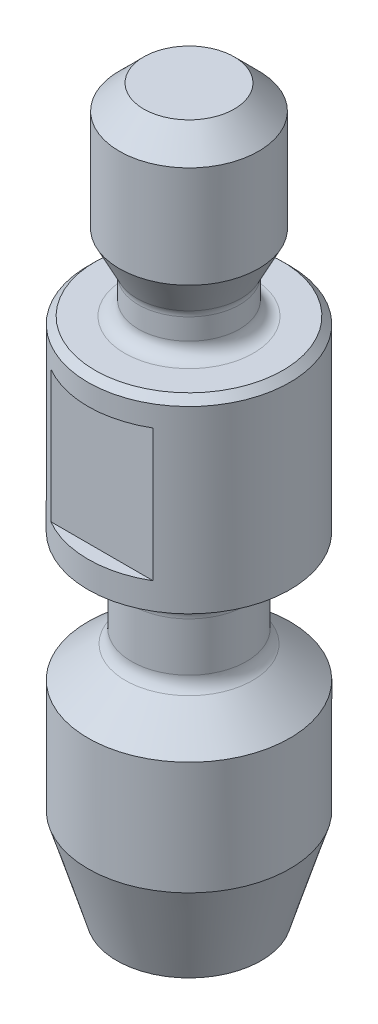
ISO-10303-21;
HEADER;
FILE_DESCRIPTION(('STEP AP214'),'2;1');
FILE_NAME('part.step','',(''),(''),'','','');
FILE_SCHEMA(('AUTOMOTIVE_DESIGN { 1 0 10303 214 1 1 1 1 }'));
ENDSEC;
DATA;
#1=APPLICATION_CONTEXT('core data for automotive mechanical design processes');
#2=APPLICATION_PROTOCOL_DEFINITION('international standard','automotive_design',2000,#1);
#3=PRODUCT_CONTEXT('',#1,'mechanical');
#4=PRODUCT('Part','Part','',(#3));
#5=PRODUCT_RELATED_PRODUCT_CATEGORY('part','',(#4));
#6=PRODUCT_DEFINITION_FORMATION('','',#4);
#7=PRODUCT_DEFINITION_CONTEXT('part definition',#1,'design');
#8=PRODUCT_DEFINITION('design','',#6,#7);
#9=PRODUCT_DEFINITION_SHAPE('','',#8);
#10=(LENGTH_UNIT() NAMED_UNIT(*) SI_UNIT(.MILLI.,.METRE.));
#11=(NAMED_UNIT(*) PLANE_ANGLE_UNIT() SI_UNIT($,.RADIAN.));
#12=(NAMED_UNIT(*) SI_UNIT($,.STERADIAN.) SOLID_ANGLE_UNIT());
#13=UNCERTAINTY_MEASURE_WITH_UNIT(LENGTH_MEASURE(1.E-05),#10,'distance_accuracy_value','');
#14=(GEOMETRIC_REPRESENTATION_CONTEXT(3) GLOBAL_UNCERTAINTY_ASSIGNED_CONTEXT((#13)) GLOBAL_UNIT_ASSIGNED_CONTEXT((#10,
#11,#12)) REPRESENTATION_CONTEXT('',''));
#15=CARTESIAN_POINT('',(0.,0.,0.));
#16=DIRECTION('',(0.,0.,1.));
#17=DIRECTION('',(1.,0.,0.));
#18=AXIS2_PLACEMENT_3D('',#15,#16,#17);
#19=CARTESIAN_POINT('',(0.,-6.07942286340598,0.));
#20=DIRECTION('',(0.,1.,0.));
#21=DIRECTION('',(0.,0.,1.));
#22=AXIS2_PLACEMENT_3D('',#19,#20,#21);
#23=CONICAL_SURFACE('',#22,1.65,1.0471975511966);
#24=CARTESIAN_POINT('',(0.,-5.93508529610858,0.));
#25=DIRECTION('',(0.,1.,0.));
#26=DIRECTION('',(0.,0.,1.));
#27=AXIS2_PLACEMENT_3D('',#24,#25,#26);
#28=CIRCLE('',#27,1.9);
#29=CARTESIAN_POINT('',(0.,-5.93508529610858,1.9));
#30=VERTEX_POINT('',#29);
#31=EDGE_CURVE('E102',#30,#30,#28,.T.);
#32=ORIENTED_EDGE('',*,*,#31,.T.);
#33=EDGE_LOOP('',(#32));
#34=FACE_BOUND('',#33,.T.);
#35=CARTESIAN_POINT('',(0.,-5.35773502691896,0.));
#36=DIRECTION('',(0.,1.,0.));
#37=DIRECTION('',(0.,0.,1.));
#38=AXIS2_PLACEMENT_3D('',#35,#36,#37);
#39=CIRCLE('',#38,2.9);
#40=CARTESIAN_POINT('',(0.,-5.35773502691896,2.9));
#41=VERTEX_POINT('',#40);
#42=EDGE_CURVE('E90',#41,#41,#39,.F.);
#43=ORIENTED_EDGE('',*,*,#42,.T.);
#44=EDGE_LOOP('',(#43));
#45=FACE_BOUND('',#44,.T.);
#46=ADVANCED_FACE('F15',(#34,#45),#23,.T.);
#47=CARTESIAN_POINT('',(0.,-9.13390996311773,0.));
#48=DIRECTION('',(0.,-1.,0.));
#49=DIRECTION('',(0.,0.,-1.));
#50=AXIS2_PLACEMENT_3D('',#47,#48,#49);
#51=CONICAL_SURFACE('',#50,3.,0.872664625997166);
#52=CARTESIAN_POINT('',(0.,-8.15099385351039,0.));
#53=DIRECTION('',(0.,-1.,0.));
#54=DIRECTION('',(0.,0.,-1.));
#55=AXIS2_PLACEMENT_3D('',#52,#53,#54);
#56=CIRCLE('',#55,1.82860619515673);
#57=CARTESIAN_POINT('',(0.,-8.15099385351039,-1.82860619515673));
#58=VERTEX_POINT('',#57);
#59=EDGE_CURVE('E105',#58,#58,#56,.T.);
#60=ORIENTED_EDGE('',*,*,#59,.T.);
#61=EDGE_LOOP('',(#60));
#62=FACE_BOUND('',#61,.T.);
#63=CARTESIAN_POINT('',(0.,-9.05,0.));
#64=DIRECTION('',(0.,-1.,0.));
#65=DIRECTION('',(0.,0.,-1.));
#66=AXIS2_PLACEMENT_3D('',#63,#64,#65);
#67=CIRCLE('',#66,2.9);
#68=CARTESIAN_POINT('',(0.,-9.05,-2.9));
#69=VERTEX_POINT('',#68);
#70=EDGE_CURVE('E87',#69,#69,#67,.F.);
#71=ORIENTED_EDGE('',*,*,#70,.T.);
#72=EDGE_LOOP('',(#71));
#73=FACE_BOUND('',#72,.T.);
#74=ADVANCED_FACE('F157',(#62,#73),#51,.T.);
#75=CARTESIAN_POINT('',(0.,0.,0.));
#76=DIRECTION('',(0.,-1.,0.));
#77=DIRECTION('',(0.,0.,-1.));
#78=AXIS2_PLACEMENT_3D('',#75,#76,#77);
#79=CYLINDRICAL_SURFACE('',#78,1.65);
#80=CARTESIAN_POINT('',(0.,-6.3680979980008,0.));
#81=DIRECTION('',(0.,-1.,0.));
#82=DIRECTION('',(0.,0.,-1.));
#83=AXIS2_PLACEMENT_3D('',#80,#81,#82);
#84=CIRCLE('',#83,1.65);
#85=CARTESIAN_POINT('',(0.,-6.3680979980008,-1.65));
#86=VERTEX_POINT('',#85);
#87=EDGE_CURVE('E99',#86,#86,#84,.T.);
#88=ORIENTED_EDGE('',*,*,#87,.T.);
#89=EDGE_LOOP('',(#88));
#90=FACE_BOUND('',#89,.T.);
#91=CARTESIAN_POINT('',(0.,-7.7679716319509,0.));
#92=DIRECTION('',(0.,-1.,0.));
#93=DIRECTION('',(0.,0.,-1.));
#94=AXIS2_PLACEMENT_3D('',#91,#92,#93);
#95=CIRCLE('',#94,1.65);
#96=CARTESIAN_POINT('',(0.,-7.7679716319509,-1.65));
#97=VERTEX_POINT('',#96);
#98=EDGE_CURVE('E96',#97,#97,#95,.F.);
#99=ORIENTED_EDGE('',*,*,#98,.T.);
#100=EDGE_LOOP('',(#99));
#101=FACE_BOUND('',#100,.T.);
#102=ADVANCED_FACE('F164',(#90,#101),#79,.T.);
#103=CARTESIAN_POINT('',(0.,-6.3680979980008,0.));
#104=DIRECTION('',(0.,-1.,0.));
#105=DIRECTION('',(0.,0.,-1.));
#106=AXIS2_PLACEMENT_3D('',#103,#104,#105);
#107=TOROIDAL_SURFACE('',#106,2.15,0.5);
#108=ORIENTED_EDGE('',*,*,#31,.F.);
#109=EDGE_LOOP('',(#108));
#110=FACE_BOUND('',#109,.T.);
#111=ORIENTED_EDGE('',*,*,#87,.F.);
#112=EDGE_LOOP('',(#111));
#113=FACE_BOUND('',#112,.T.);
#114=ADVANCED_FACE('F176',(#110,#113),#107,.F.);
#115=CARTESIAN_POINT('',(0.,-7.7679716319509,0.));
#116=DIRECTION('',(0.,-1.,0.));
#117=DIRECTION('',(0.,0.,-1.));
#118=AXIS2_PLACEMENT_3D('',#115,#116,#117);
#119=TOROIDAL_SURFACE('',#118,2.15,0.5);
#120=ORIENTED_EDGE('',*,*,#98,.F.);
#121=EDGE_LOOP('',(#120));
#122=FACE_BOUND('',#121,.T.);
#123=ORIENTED_EDGE('',*,*,#59,.F.);
#124=EDGE_LOOP('',(#123));
#125=FACE_BOUND('',#124,.T.);
#126=ADVANCED_FACE('F179',(#122,#125),#119,.F.);
#127=CARTESIAN_POINT('',(0.,0.,0.));
#128=DIRECTION('',(0.,1.,0.));
#129=DIRECTION('',(-1.,0.,0.));
#130=AXIS2_PLACEMENT_3D('',#127,#128,#129);
#131=CYLINDRICAL_SURFACE('',#130,2.9);
#132=DIRECTION('',(0.,1.,0.));
#133=VECTOR('',#132,1.);
#134=CARTESIAN_POINT('',(-1.4696938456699,0.,-2.5));
#135=LINE('',#134,#133);
#136=CARTESIAN_POINT('',(-1.4696938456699,-4.6,-2.5));
#137=VERTEX_POINT('',#136);
#138=CARTESIAN_POINT('',(-1.4696938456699,-0.8,-2.5));
#139=VERTEX_POINT('',#138);
#140=EDGE_CURVE('E134',#137,#139,#135,.T.);
#141=ORIENTED_EDGE('',*,*,#140,.F.);
#142=CARTESIAN_POINT('',(0.,-4.6,0.));
#143=DIRECTION('',(0.,-1.,0.));
#144=DIRECTION('',(0.,0.,-1.));
#145=AXIS2_PLACEMENT_3D('',#142,#143,#144);
#146=CIRCLE('',#145,2.9);
#147=CARTESIAN_POINT('',(1.4696938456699,-4.6,-2.5));
#148=VERTEX_POINT('',#147);
#149=EDGE_CURVE('E9',#148,#137,#146,.F.);
#150=ORIENTED_EDGE('',*,*,#149,.F.);
#151=DIRECTION('',(0.,1.,0.));
#152=VECTOR('',#151,1.);
#153=CARTESIAN_POINT('',(1.4696938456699,0.,-2.5));
#154=LINE('',#153,#152);
#155=CARTESIAN_POINT('',(1.4696938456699,-0.8,-2.5));
#156=VERTEX_POINT('',#155);
#157=EDGE_CURVE('E23',#156,#148,#154,.F.);
#158=ORIENTED_EDGE('',*,*,#157,.F.);
#159=CARTESIAN_POINT('',(0.,-0.8,0.));
#160=DIRECTION('',(0.,1.,0.));
#161=DIRECTION('',(0.,0.,1.));
#162=AXIS2_PLACEMENT_3D('',#159,#160,#161);
#163=CIRCLE('',#162,2.9);
#164=EDGE_CURVE('E70',#139,#156,#163,.F.);
#165=ORIENTED_EDGE('',*,*,#164,.F.);
#166=EDGE_LOOP('',(#141,#150,#158,#165));
#167=FACE_BOUND('',#166,.T.);
#168=DIRECTION('',(0.,1.,0.));
#169=VECTOR('',#168,1.);
#170=CARTESIAN_POINT('',(-1.4696938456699,0.,2.5));
#171=LINE('',#170,#169);
#172=CARTESIAN_POINT('',(-1.4696938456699,-0.8,2.5));
#173=VERTEX_POINT('',#172);
#174=CARTESIAN_POINT('',(-1.4696938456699,-4.6,2.5));
#175=VERTEX_POINT('',#174);
#176=EDGE_CURVE('E61',#173,#175,#171,.F.);
#177=ORIENTED_EDGE('',*,*,#176,.F.);
#178=CARTESIAN_POINT('',(0.,-0.8,0.));
#179=DIRECTION('',(0.,1.,0.));
#180=DIRECTION('',(0.,0.,1.));
#181=AXIS2_PLACEMENT_3D('',#178,#179,#180);
#182=CIRCLE('',#181,2.9);
#183=CARTESIAN_POINT('',(1.4696938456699,-0.8,2.5));
#184=VERTEX_POINT('',#183);
#185=EDGE_CURVE('E64',#184,#173,#182,.F.);
#186=ORIENTED_EDGE('',*,*,#185,.F.);
#187=DIRECTION('',(0.,1.,0.));
#188=VECTOR('',#187,1.);
#189=CARTESIAN_POINT('',(1.4696938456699,0.,2.5));
#190=LINE('',#189,#188);
#191=CARTESIAN_POINT('',(1.4696938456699,-4.6,2.5));
#192=VERTEX_POINT('',#191);
#193=EDGE_CURVE('E62',#192,#184,#190,.T.);
#194=ORIENTED_EDGE('',*,*,#193,.F.);
#195=CARTESIAN_POINT('',(0.,-4.6,0.));
#196=DIRECTION('',(0.,-1.,0.));
#197=DIRECTION('',(0.,0.,-1.));
#198=AXIS2_PLACEMENT_3D('',#195,#196,#197);
#199=CIRCLE('',#198,2.9);
#200=EDGE_CURVE('E57',#175,#192,#199,.F.);
#201=ORIENTED_EDGE('',*,*,#200,.F.);
#202=EDGE_LOOP('',(#177,#186,#194,#201));
#203=FACE_BOUND('',#202,.T.);
#204=ORIENTED_EDGE('',*,*,#42,.F.);
#205=EDGE_LOOP('',(#204));
#206=FACE_BOUND('',#205,.T.);
#207=CARTESIAN_POINT('',(0.,-0.200000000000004,0.));
#208=DIRECTION('',(0.,-1.,0.));
#209=DIRECTION('',(0.,0.,-1.));
#210=AXIS2_PLACEMENT_3D('',#207,#208,#209);
#211=CIRCLE('',#210,2.9);
#212=CARTESIAN_POINT('',(0.,-0.200000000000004,-2.9));
#213=VERTEX_POINT('',#212);
#214=EDGE_CURVE('E83',#213,#213,#211,.F.);
#215=ORIENTED_EDGE('',*,*,#214,.F.);
#216=EDGE_LOOP('',(#215));
#217=FACE_BOUND('',#216,.T.);
#218=ADVANCED_FACE('F58',(#167,#203,#206,#217),#131,.T.);
#219=ORIENTED_EDGE('',*,*,#70,.F.);
#220=EDGE_LOOP('',(#219));
#221=FACE_BOUND('',#220,.T.);
#222=CARTESIAN_POINT('',(0.,-12.3000852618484,0.));
#223=DIRECTION('',(0.,1.,0.));
#224=DIRECTION('',(0.,0.,1.));
#225=AXIS2_PLACEMENT_3D('',#222,#223,#224);
#226=CIRCLE('',#225,2.9);
#227=CARTESIAN_POINT('',(0.,-12.3000852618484,2.9));
#228=VERTEX_POINT('',#227);
#229=EDGE_CURVE('E84',#228,#228,#226,.F.);
#230=ORIENTED_EDGE('',*,*,#229,.F.);
#231=EDGE_LOOP('',(#230));
#232=FACE_BOUND('',#231,.T.);
#233=ADVANCED_FACE('F174',(#221,#232),#131,.T.);
#234=CARTESIAN_POINT('',(0.,0.,0.));
#235=DIRECTION('',(0.,1.,0.));
#236=DIRECTION('',(0.,0.,1.));
#237=AXIS2_PLACEMENT_3D('',#234,#235,#236);
#238=PLANE('',#237);
#239=CARTESIAN_POINT('',(0.,0.,0.));
#240=DIRECTION('',(0.,1.,0.));
#241=DIRECTION('',(0.,0.,1.));
#242=AXIS2_PLACEMENT_3D('',#239,#240,#241);
#243=CIRCLE('',#242,1.85);
#244=CARTESIAN_POINT('',(0.,0.,1.85));
#245=VERTEX_POINT('',#244);
#246=EDGE_CURVE('E128',#245,#245,#243,.F.);
#247=ORIENTED_EDGE('',*,*,#246,.T.);
#248=EDGE_LOOP('',(#247));
#249=FACE_BOUND('',#248,.T.);
#250=CARTESIAN_POINT('',(0.,0.,0.));
#251=DIRECTION('',(0.,1.,0.));
#252=DIRECTION('',(0.,0.,1.));
#253=AXIS2_PLACEMENT_3D('',#250,#251,#252);
#254=CIRCLE('',#253,2.7);
#255=CARTESIAN_POINT('',(0.,0.,2.7));
#256=VERTEX_POINT('',#255);
#257=EDGE_CURVE('E108',#256,#256,#254,.T.);
#258=ORIENTED_EDGE('',*,*,#257,.T.);
#259=EDGE_LOOP('',(#258));
#260=FACE_BOUND('',#259,.T.);
#261=ADVANCED_FACE('F170',(#249,#260),#238,.T.);
#262=CARTESIAN_POINT('',(0.,-0.300000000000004,0.));
#263=DIRECTION('',(0.,-1.,0.));
#264=DIRECTION('',(0.,0.,-1.));
#265=AXIS2_PLACEMENT_3D('',#262,#263,#264);
#266=CONICAL_SURFACE('',#265,3.,0.78539816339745);
#267=ORIENTED_EDGE('',*,*,#257,.F.);
#268=EDGE_LOOP('',(#267));
#269=FACE_BOUND('',#268,.T.);
#270=ORIENTED_EDGE('',*,*,#214,.T.);
#271=EDGE_LOOP('',(#270));
#272=FACE_BOUND('',#271,.T.);
#273=ADVANCED_FACE('F173',(#269,#272),#266,.T.);
#274=CARTESIAN_POINT('',(2.07455322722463,-15.,0.));
#275=DIRECTION('',(0.,-1.,0.));
#276=DIRECTION('',(0.,0.,-1.));
#277=AXIS2_PLACEMENT_3D('',#274,#275,#276);
#278=PLANE('',#277);
#279=CARTESIAN_POINT('',(0.,-15.,0.));
#280=DIRECTION('',(0.,-1.,0.));
#281=DIRECTION('',(0.,0.,-1.));
#282=AXIS2_PLACEMENT_3D('',#279,#280,#281);
#283=CIRCLE('',#282,2.07455322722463);
#284=CARTESIAN_POINT('',(0.,-15.,-2.07455322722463));
#285=VERTEX_POINT('',#284);
#286=EDGE_CURVE('E93',#285,#285,#283,.T.);
#287=ORIENTED_EDGE('',*,*,#286,.T.);
#288=EDGE_LOOP('',(#287));
#289=FACE_BOUND('',#288,.T.);
#290=ADVANCED_FACE('F190',(#289),#278,.T.);
#291=CARTESIAN_POINT('',(0.,-15.,0.));
#292=DIRECTION('',(0.,1.,0.));
#293=DIRECTION('',(0.,0.,1.));
#294=AXIS2_PLACEMENT_3D('',#291,#292,#293);
#295=CONICAL_SURFACE('',#294,2.07455322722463,0.296705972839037);
#296=ORIENTED_EDGE('',*,*,#286,.F.);
#297=EDGE_LOOP('',(#296));
#298=FACE_BOUND('',#297,.T.);
#299=ORIENTED_EDGE('',*,*,#229,.T.);
#300=EDGE_LOOP('',(#299));
#301=FACE_BOUND('',#300,.T.);
#302=ADVANCED_FACE('F236',(#298,#301),#295,.T.);
#303=CARTESIAN_POINT('',(0.,2.17943577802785,0.));
#304=DIRECTION('',(0.,1.,0.));
#305=DIRECTION('',(0.,0.,1.));
#306=AXIS2_PLACEMENT_3D('',#303,#304,#305);
#307=CONICAL_SURFACE('',#306,2.,0.471238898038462);
#308=CARTESIAN_POINT('',(0.,1.18556469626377,0.));
#309=DIRECTION('',(0.,1.,0.));
#310=DIRECTION('',(0.,0.,1.));
#311=AXIS2_PLACEMENT_3D('',#308,#309,#310);
#312=CIRCLE('',#311,1.49359739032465);
#313=CARTESIAN_POINT('',(0.,1.18556469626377,1.49359739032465));
#314=VERTEX_POINT('',#313);
#315=EDGE_CURVE('E125',#314,#314,#312,.T.);
#316=ORIENTED_EDGE('',*,*,#315,.T.);
#317=EDGE_LOOP('',(#316));
#318=FACE_BOUND('',#317,.T.);
#319=CARTESIAN_POINT('',(0.,2.17943577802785,0.));
#320=DIRECTION('',(0.,-1.,0.));
#321=DIRECTION('',(0.,0.,-1.));
#322=AXIS2_PLACEMENT_3D('',#319,#320,#321);
#323=CIRCLE('',#322,2.);
#324=CARTESIAN_POINT('',(0.,2.17943577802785,-2.));
#325=VERTEX_POINT('',#324);
#326=EDGE_CURVE('E80',#325,#325,#323,.T.);
#327=ORIENTED_EDGE('',*,*,#326,.T.);
#328=EDGE_LOOP('',(#327));
#329=FACE_BOUND('',#328,.T.);
#330=ADVANCED_FACE('F215',(#318,#329),#307,.T.);
#331=CARTESIAN_POINT('',(0.,0.,0.));
#332=DIRECTION('',(0.,-1.,0.));
#333=DIRECTION('',(0.,0.,-1.));
#334=AXIS2_PLACEMENT_3D('',#331,#332,#333);
#335=CYLINDRICAL_SURFACE('',#334,1.45);
#336=CARTESIAN_POINT('',(0.,1.00396849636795,0.));
#337=DIRECTION('',(0.,-1.,0.));
#338=DIRECTION('',(0.,0.,-1.));
#339=AXIS2_PLACEMENT_3D('',#336,#337,#338);
#340=CIRCLE('',#339,1.45);
#341=CARTESIAN_POINT('',(0.,1.00396849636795,-1.45));
#342=VERTEX_POINT('',#341);
#343=EDGE_CURVE('E122',#342,#342,#340,.T.);
#344=ORIENTED_EDGE('',*,*,#343,.T.);
#345=EDGE_LOOP('',(#344));
#346=FACE_BOUND('',#345,.T.);
#347=CARTESIAN_POINT('',(0.,0.4,0.));
#348=DIRECTION('',(0.,1.,0.));
#349=DIRECTION('',(0.,0.,1.));
#350=AXIS2_PLACEMENT_3D('',#347,#348,#349);
#351=CIRCLE('',#350,1.45);
#352=CARTESIAN_POINT('',(0.,0.4,1.45));
#353=VERTEX_POINT('',#352);
#354=EDGE_CURVE('E119',#353,#353,#351,.T.);
#355=ORIENTED_EDGE('',*,*,#354,.T.);
#356=EDGE_LOOP('',(#355));
#357=FACE_BOUND('',#356,.T.);
#358=ADVANCED_FACE('F212',(#346,#357),#335,.T.);
#359=CARTESIAN_POINT('',(0.,5.8,0.));
#360=DIRECTION('',(0.,1.,0.));
#361=DIRECTION('',(0.,0.,1.));
#362=AXIS2_PLACEMENT_3D('',#359,#360,#361);
#363=PLANE('',#362);
#364=CARTESIAN_POINT('',(0.,5.8,0.));
#365=DIRECTION('',(0.,1.,0.));
#366=DIRECTION('',(0.,0.,1.));
#367=AXIS2_PLACEMENT_3D('',#364,#365,#366);
#368=CIRCLE('',#367,1.3);
#369=CARTESIAN_POINT('',(0.,5.8,1.3));
#370=VERTEX_POINT('',#369);
#371=EDGE_CURVE('E116',#370,#370,#368,.T.);
#372=ORIENTED_EDGE('',*,*,#371,.T.);
#373=EDGE_LOOP('',(#372));
#374=FACE_BOUND('',#373,.T.);
#375=ADVANCED_FACE('F195',(#374),#363,.T.);
#376=CARTESIAN_POINT('',(0.,5.1,0.));
#377=DIRECTION('',(0.,-1.,0.));
#378=DIRECTION('',(0.,0.,-1.));
#379=AXIS2_PLACEMENT_3D('',#376,#377,#378);
#380=CONICAL_SURFACE('',#379,2.,0.78539816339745);
#381=ORIENTED_EDGE('',*,*,#371,.F.);
#382=EDGE_LOOP('',(#381));
#383=FACE_BOUND('',#382,.T.);
#384=CARTESIAN_POINT('',(0.,5.1,0.));
#385=DIRECTION('',(0.,1.,0.));
#386=DIRECTION('',(0.,0.,1.));
#387=AXIS2_PLACEMENT_3D('',#384,#385,#386);
#388=CIRCLE('',#387,2.);
#389=CARTESIAN_POINT('',(0.,5.1,2.));
#390=VERTEX_POINT('',#389);
#391=EDGE_CURVE('E111',#390,#390,#388,.F.);
#392=ORIENTED_EDGE('',*,*,#391,.F.);
#393=EDGE_LOOP('',(#392));
#394=FACE_BOUND('',#393,.T.);
#395=ADVANCED_FACE('F192',(#383,#394),#380,.T.);
#396=CARTESIAN_POINT('',(0.,0.,0.));
#397=DIRECTION('',(0.,-1.,0.));
#398=DIRECTION('',(0.,0.,-1.));
#399=AXIS2_PLACEMENT_3D('',#396,#397,#398);
#400=CYLINDRICAL_SURFACE('',#399,2.);
#401=ORIENTED_EDGE('',*,*,#326,.F.);
#402=EDGE_LOOP('',(#401));
#403=FACE_BOUND('',#402,.T.);
#404=ORIENTED_EDGE('',*,*,#391,.T.);
#405=EDGE_LOOP('',(#404));
#406=FACE_BOUND('',#405,.T.);
#407=ADVANCED_FACE('F194',(#403,#406),#400,.T.);
#408=CARTESIAN_POINT('',(0.,1.00396849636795,0.));
#409=DIRECTION('',(0.,-1.,0.));
#410=DIRECTION('',(0.,0.,-1.));
#411=AXIS2_PLACEMENT_3D('',#408,#409,#410);
#412=TOROIDAL_SURFACE('',#411,1.85,0.4);
#413=ORIENTED_EDGE('',*,*,#315,.F.);
#414=EDGE_LOOP('',(#413));
#415=FACE_BOUND('',#414,.T.);
#416=ORIENTED_EDGE('',*,*,#343,.F.);
#417=EDGE_LOOP('',(#416));
#418=FACE_BOUND('',#417,.T.);
#419=ADVANCED_FACE('F197',(#415,#418),#412,.F.);
#420=CARTESIAN_POINT('',(0.,0.4,0.));
#421=DIRECTION('',(0.,1.,0.));
#422=DIRECTION('',(0.,0.,1.));
#423=AXIS2_PLACEMENT_3D('',#420,#421,#422);
#424=TOROIDAL_SURFACE('',#423,1.85,0.4);
#425=ORIENTED_EDGE('',*,*,#354,.F.);
#426=EDGE_LOOP('',(#425));
#427=FACE_BOUND('',#426,.T.);
#428=ORIENTED_EDGE('',*,*,#246,.F.);
#429=EDGE_LOOP('',(#428));
#430=FACE_BOUND('',#429,.T.);
#431=ADVANCED_FACE('F17',(#427,#430),#424,.F.);
#432=CARTESIAN_POINT('',(-5.,-4.6,2.9));
#433=DIRECTION('',(0.,-1.,0.));
#434=DIRECTION('',(0.,0.,-1.));
#435=AXIS2_PLACEMENT_3D('',#432,#433,#434);
#436=PLANE('',#435);
#437=DIRECTION('',(1.,0.,0.));
#438=VECTOR('',#437,1.);
#439=CARTESIAN_POINT('',(-5.,-4.6,2.5));
#440=LINE('',#439,#438);
#441=EDGE_CURVE('E30',#175,#192,#440,.T.);
#442=ORIENTED_EDGE('',*,*,#441,.F.);
#443=ORIENTED_EDGE('',*,*,#200,.T.);
#444=EDGE_LOOP('',(#442,#443));
#445=FACE_BOUND('',#444,.T.);
#446=ADVANCED_FACE('F72',(#445),#436,.F.);
#447=CARTESIAN_POINT('',(-5.,-0.8,2.9));
#448=DIRECTION('',(0.,1.,0.));
#449=DIRECTION('',(0.,0.,1.));
#450=AXIS2_PLACEMENT_3D('',#447,#448,#449);
#451=PLANE('',#450);
#452=ORIENTED_EDGE('',*,*,#185,.T.);
#453=DIRECTION('',(1.,0.,0.));
#454=VECTOR('',#453,1.);
#455=CARTESIAN_POINT('',(-5.,-0.8,2.5));
#456=LINE('',#455,#454);
#457=EDGE_CURVE('E69',#173,#184,#456,.T.);
#458=ORIENTED_EDGE('',*,*,#457,.T.);
#459=EDGE_LOOP('',(#452,#458));
#460=FACE_BOUND('',#459,.T.);
#461=ADVANCED_FACE('F154',(#460),#451,.F.);
#462=CARTESIAN_POINT('',(-5.,-4.6,2.5));
#463=DIRECTION('',(0.,0.,-1.));
#464=DIRECTION('',(0.,1.,0.));
#465=AXIS2_PLACEMENT_3D('',#462,#463,#464);
#466=PLANE('',#465);
#467=ORIENTED_EDGE('',*,*,#176,.T.);
#468=ORIENTED_EDGE('',*,*,#441,.T.);
#469=ORIENTED_EDGE('',*,*,#193,.T.);
#470=ORIENTED_EDGE('',*,*,#457,.F.);
#471=EDGE_LOOP('',(#467,#468,#469,#470));
#472=FACE_BOUND('',#471,.T.);
#473=ADVANCED_FACE('F67',(#472),#466,.F.);
#474=CARTESIAN_POINT('',(-5.,-4.6,-2.9));
#475=DIRECTION('',(0.,-1.,0.));
#476=DIRECTION('',(0.,0.,-1.));
#477=AXIS2_PLACEMENT_3D('',#474,#475,#476);
#478=PLANE('',#477);
#479=ORIENTED_EDGE('',*,*,#149,.T.);
#480=DIRECTION('',(1.,0.,0.));
#481=VECTOR('',#480,1.);
#482=CARTESIAN_POINT('',(-5.,-4.6,-2.5));
#483=LINE('',#482,#481);
#484=EDGE_CURVE('E75',#137,#148,#483,.T.);
#485=ORIENTED_EDGE('',*,*,#484,.T.);
#486=EDGE_LOOP('',(#479,#485));
#487=FACE_BOUND('',#486,.T.);
#488=ADVANCED_FACE('F144',(#487),#478,.F.);
#489=CARTESIAN_POINT('',(-5.,-4.6,-2.5));
#490=DIRECTION('',(0.,0.,1.));
#491=DIRECTION('',(1.,0.,0.));
#492=AXIS2_PLACEMENT_3D('',#489,#490,#491);
#493=PLANE('',#492);
#494=ORIENTED_EDGE('',*,*,#157,.T.);
#495=ORIENTED_EDGE('',*,*,#484,.F.);
#496=ORIENTED_EDGE('',*,*,#140,.T.);
#497=DIRECTION('',(1.,0.,0.));
#498=VECTOR('',#497,1.);
#499=CARTESIAN_POINT('',(-5.,-0.8,-2.5));
#500=LINE('',#499,#498);
#501=EDGE_CURVE('E73',#139,#156,#500,.T.);
#502=ORIENTED_EDGE('',*,*,#501,.T.);
#503=EDGE_LOOP('',(#494,#495,#496,#502));
#504=FACE_BOUND('',#503,.T.);
#505=ADVANCED_FACE('F138',(#504),#493,.F.);
#506=CARTESIAN_POINT('',(-5.,-0.8,-2.9));
#507=DIRECTION('',(0.,1.,0.));
#508=DIRECTION('',(0.,0.,1.));
#509=AXIS2_PLACEMENT_3D('',#506,#507,#508);
#510=PLANE('',#509);
#511=ORIENTED_EDGE('',*,*,#501,.F.);
#512=ORIENTED_EDGE('',*,*,#164,.T.);
#513=EDGE_LOOP('',(#511,#512));
#514=FACE_BOUND('',#513,.T.);
#515=ADVANCED_FACE('F142',(#514),#510,.F.);
#516=CLOSED_SHELL('',(#46,#74,#102,#114,#126,#218,#233,#261,#273,#290,#302,#330,#358,#375,#395,
#407,#419,#431,#446,#461,#473,#488,#505,#515));
#517=MANIFOLD_SOLID_BREP('B1',#516);
#518=ADVANCED_BREP_SHAPE_REPRESENTATION('',(#18,#517),#14);
#519=SHAPE_DEFINITION_REPRESENTATION(#9,#518);
ENDSEC;
END-ISO-10303-21;
